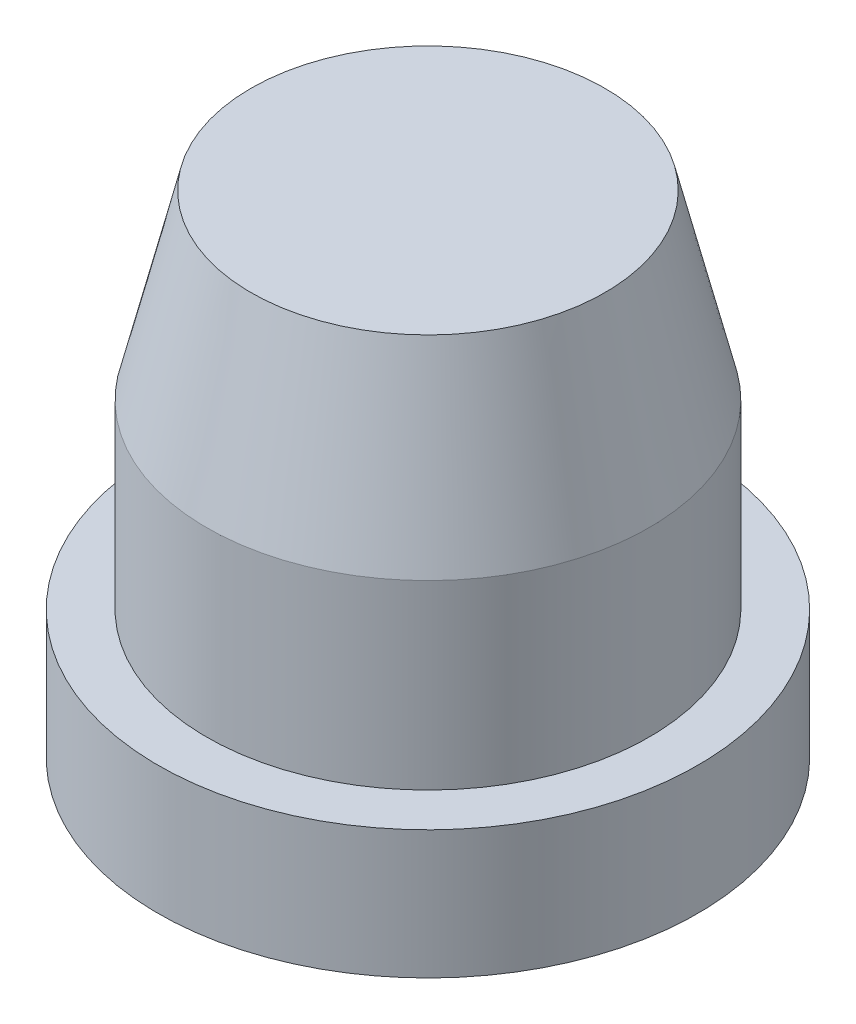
from build123d import *

# Parameters (mm, degrees)
SKETCH_2_R          = 2.8
CUT_EXTRUDE_1_DEPTH = 2.3
SKETCH_3_R          = 4
CUT_EXTRUDE_2_DEPTH = 7.9
FILLET_1_R          = 1.5


with BuildPart() as part:
    # Sketch 1 → Revolve 1 (revolve)
    with BuildSketch(Plane.XY):
        Polygon((0, 0), (-6.1, 0), (-6.1, 2.9), (-5, 2.9), (-5, 7), (-4, 11.1), (0, 11.1), align=None)
    revolve(axis=Axis((0, 11.1, 0), (0, -1, 0)))

    # Sketch 2 → Cut-Extrude 1 (cut)
    with BuildSketch(Plane.XZ):
        Circle(SKETCH_2_R)
    extrude(amount=-CUT_EXTRUDE_1_DEPTH, mode=Mode.SUBTRACT)

    # Sketch 3 → Cut-Extrude 2 (cut)
    with BuildSketch(Plane.XZ.offset(-2.3)):
        Circle(SKETCH_3_R)
    extrude(amount=-CUT_EXTRUDE_2_DEPTH, mode=Mode.SUBTRACT)

    # Fillet 1
    fillet_1_edges = [part.edges().sort_by_distance(p)[0] for p in [
        (-2.8, 0, 0),
    ]]
    fillet(fillet_1_edges, radius=FILLET_1_R)


solid = part.part
